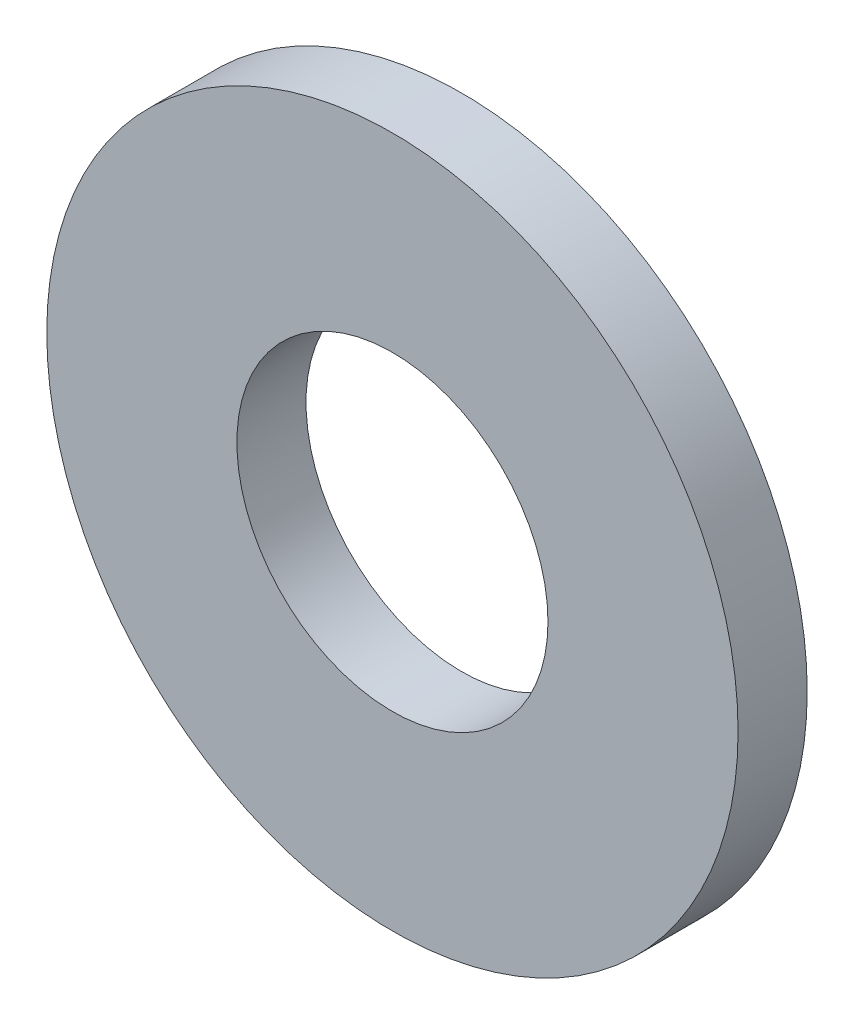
from build123d import *

# Parameters (mm, degrees)
SKETCH1_R    = 7.9375
SKETCH1_R_2  = 3.571875
WASHER_DEPTH = 1.5875


with BuildPart() as part:
    # Sketch1 → Washer (new body)
    with BuildSketch(Plane.XY):
        Circle(SKETCH1_R)
        Circle(SKETCH1_R_2, mode=Mode.SUBTRACT)
    extrude(amount=WASHER_DEPTH)


solid = part.part
